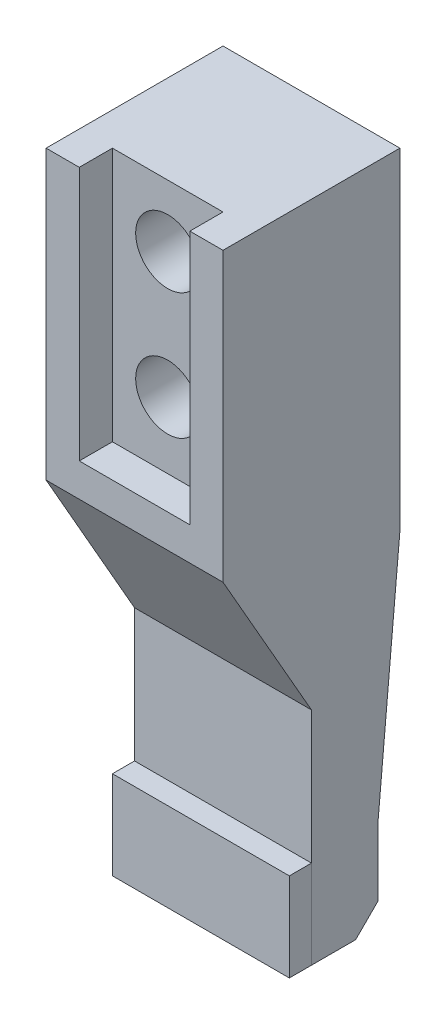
from build123d import *

# Parameters (mm, degrees)
SKETCH_1_W               = 8
SKETCH_1_H               = 30
EXTRUDE_1_DEPTH          = 8
SKETCH_2_W               = 5
SKETCH_2_H               = 11.5
CUT_EXTRUDE_1_DEPTH      = 1.5
CUT_EXTRUDE_2_DEPTH      = 19.788294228
CUT_EXTRUDE_2_DEPTH_BACK = 19.788294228
SKETCH_3_W               = 0.5
SKETCH_3_H               = 4
HOLE_WIZARD_M2_5_1_D     = 2.9
CUT_EXTRUDE_3_DEPTH      = 19.788294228
CHAMFER_3_SIZE           = 1
SKETCH_7_W               = 8
SKETCH_7_H               = 4
EXTRUDE_2_DEPTH          = 1


with BuildPart() as part:
    # Sketch 1 → Extrude 1 (new body)
    with BuildSketch(Plane.XY):
        Rectangle(SKETCH_1_W, SKETCH_1_H)
    extrude(amount=EXTRUDE_1_DEPTH)

    # Sketch 2 → Cut-Extrude 1 (cut)
    with BuildSketch(Plane.XY.offset(8)):
        with Locations((0, 9.25)):
            Rectangle(SKETCH_2_W, SKETCH_2_H)
    extrude(amount=-CUT_EXTRUDE_1_DEPTH, mode=Mode.SUBTRACT)

    # Sketch 3 → Cut-Extrude 2 (cut, two sides: drawn at the far end of the back side and taken through both)
    with BuildSketch(Plane(origin=(4, 0, 0), x_dir=(0, 0, -1), z_dir=(1, 0, 0)).offset(-CUT_EXTRUDE_2_DEPTH_BACK)):
        Polygon((-4, -5), (-8, 2), (-8, -15), (-4.5, -15), (-4.5, -11), (-4, -11), align=None)
        with Locations((-4.25, -13)):
            Rectangle(SKETCH_3_W, SKETCH_3_H)
    extrude(amount=CUT_EXTRUDE_2_DEPTH + CUT_EXTRUDE_2_DEPTH_BACK, mode=Mode.SUBTRACT)

    # Hole Wizard M2.5 _1 (through all)
    with Locations(Plane(origin=(0, 0, 0), x_dir=(-1, 0, 0), z_dir=(0, 0, -1))):
        with Locations((0, 6.5), (0, 12.2)):
            Hole(HOLE_WIZARD_M2_5_1_D / 2)

    # Sketch 6 → Cut-Extrude 3 (cut, through all)
    with BuildSketch(Plane(origin=(4, 0, 0), x_dir=(0, 0, -1), z_dir=(1, 0, 0))):
        Polygon((-1, -15), (-1, -11), (0, 0), (0, -15), align=None)
    extrude(amount=-CUT_EXTRUDE_3_DEPTH, mode=Mode.SUBTRACT)

    # Chamfer 3
    chamfer_3_edges = [part.edges().sort_by_distance(p)[0] for p in [
        (0, -15, 1),
    ]]
    chamfer(chamfer_3_edges, length=CHAMFER_3_SIZE)


with BuildPart() as body_2:
    # Sketch 7 → Extrude 2 (new body)
    with BuildSketch(Plane.XY.offset(4)):
        with Locations((0, -13)):
            Rectangle(SKETCH_7_W, SKETCH_7_H)
    extrude(amount=EXTRUDE_2_DEPTH)


solid = Compound([part.part, body_2.part])
